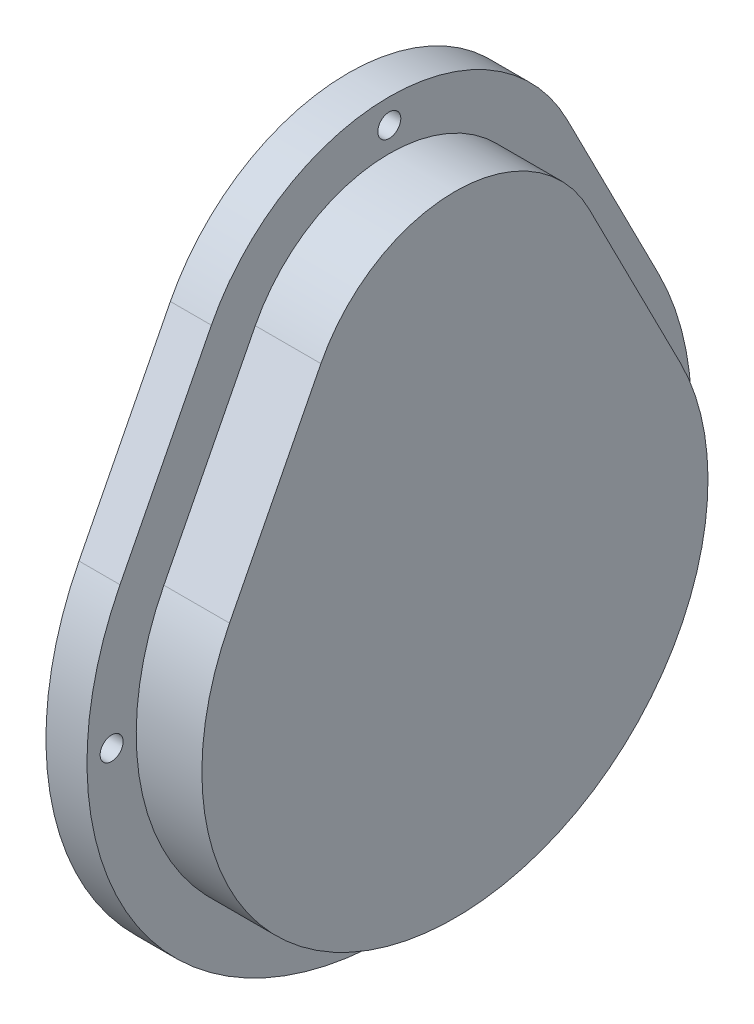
from build123d import *

# Parameters (mm, degrees)
BOSS_EXTRUDE2_DEPTH = 3.175
BOSS_EXTRUDE4_START = -5.08
BOSS_EXTRUDE4_DEPTH = 5.08
SKETCH4_R           = 0.889
BOSS_EXTRUDE6_DEPTH = 3.175


with BuildPart() as part:
    # Sketch1 → Boss-Extrude2 (new body)
    with BuildSketch(Plane.YZ):
        with BuildLine():
            Line((8.899813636, -17.440001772), (22.754359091, -10.369883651))
            ThreePointArc((22.754359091, -10.369883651), (29.10459, 0), (22.754359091, 10.369883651))
            Line((22.754359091, 10.369883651), (8.899813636, 17.440001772))
            ThreePointArc((8.899813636, 17.440001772), (-19.57959, 0), (8.899813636, -17.440001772))
        make_face()
    extrude(amount=BOSS_EXTRUDE2_DEPTH)

    # Sketch1_9 → Boss-Extrude4 (add)
    with BuildSketch(Plane.YZ.offset(BOSS_EXTRUDE4_START)):
        with BuildLine():
            Line((8.899813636, -17.440001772), (22.754359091, -10.369883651))
            ThreePointArc((22.754359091, -10.369883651), (29.10459, 0), (22.754359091, 10.369883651))
            Line((22.754359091, 10.369883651), (8.899813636, 17.440001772))
            ThreePointArc((8.899813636, 17.440001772), (-19.57959, 0), (8.899813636, -17.440001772))
        make_face()
        with BuildLine():
            Line((7.456631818, 14.611954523), (21.311177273, 7.541836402))
            ThreePointArc((21.311177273, 7.541836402), (25.92959, 0), (21.311177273, -7.541836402))
            Line((21.311177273, -7.541836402), (7.456631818, -14.611954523))
            ThreePointArc((7.456631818, -14.611954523), (-16.40459, 0), (7.456631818, 14.611954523))
        make_face(mode=Mode.SUBTRACT)
    extrude(amount=BOSS_EXTRUDE4_DEPTH)

    # Sketch4 → Boss-Extrude6 (add)
    with BuildSketch(Plane(origin=(-5.08, 0, 0), x_dir=(0, -1, 0), z_dir=(-1, 0, 0))):
        with BuildLine():
            Line((-24.486177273, -13.763540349), (-10.631631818, -20.83365847))
            ThreePointArc((-10.631631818, -20.83365847), (23.38959, 0), (-10.631631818, 20.83365847))
            Line((-10.631631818, 20.83365847), (-24.486177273, 13.763540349))
            ThreePointArc((-24.486177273, 13.763540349), (-32.91459, 0), (-24.486177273, -13.763540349))
        make_face()
        with Locations(Location((0, -21.48459, 0), (0, 0, 90))):
            Circle(SKETCH4_R, mode=Mode.SUBTRACT)
        with Locations(Location((-31.00959, 0, 0), (0, 0, 90))):
            Circle(SKETCH4_R, mode=Mode.SUBTRACT)
        with Locations(Location((21.48459, 0, 0), (0, 0, 90))):
            Circle(SKETCH4_R, mode=Mode.SUBTRACT)
        with Locations(Location((0, 21.48459, 0), (0, 0, 90))):
            Circle(SKETCH4_R, mode=Mode.SUBTRACT)
        with BuildLine():
            Line((-8.899813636, -17.440001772), (-22.754359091, -10.369883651))
            ThreePointArc((-22.754359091, -10.369883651), (-29.10459, 0), (-22.754359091, 10.369883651))
            Line((-22.754359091, 10.369883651), (-8.899813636, 17.440001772))
            ThreePointArc((-8.899813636, 17.440001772), (19.57959, 0), (-8.899813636, -17.440001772))
        make_face(mode=Mode.SUBTRACT)
    extrude(amount=-BOSS_EXTRUDE6_DEPTH)


solid = part.part
